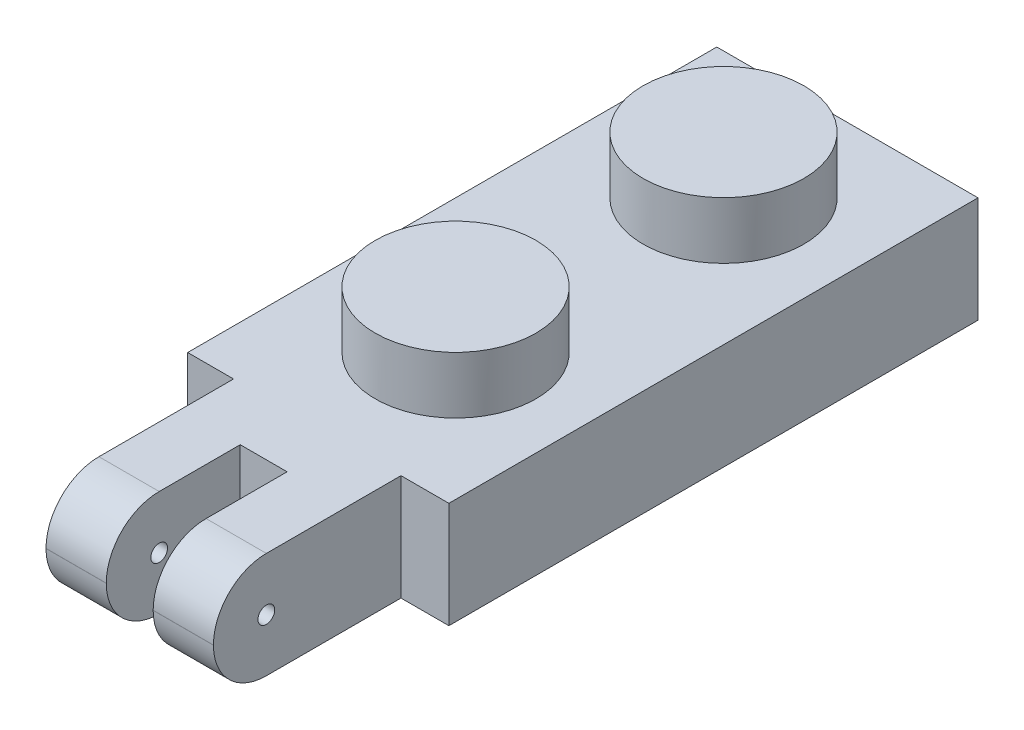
ISO-10303-21;
HEADER;
FILE_DESCRIPTION(('STEP AP214'),'2;1');
FILE_NAME('part.step','',(''),(''),'','','');
FILE_SCHEMA(('AUTOMOTIVE_DESIGN { 1 0 10303 214 1 1 1 1 }'));
ENDSEC;
DATA;
#1=APPLICATION_CONTEXT('core data for automotive mechanical design processes');
#2=APPLICATION_PROTOCOL_DEFINITION('international standard','automotive_design',2000,#1);
#3=PRODUCT_CONTEXT('',#1,'mechanical');
#4=PRODUCT('Part','Part','',(#3));
#5=PRODUCT_RELATED_PRODUCT_CATEGORY('part','',(#4));
#6=PRODUCT_DEFINITION_FORMATION('','',#4);
#7=PRODUCT_DEFINITION_CONTEXT('part definition',#1,'design');
#8=PRODUCT_DEFINITION('design','',#6,#7);
#9=PRODUCT_DEFINITION_SHAPE('','',#8);
#10=(LENGTH_UNIT() NAMED_UNIT(*) SI_UNIT(.MILLI.,.METRE.));
#11=(NAMED_UNIT(*) PLANE_ANGLE_UNIT() SI_UNIT($,.RADIAN.));
#12=(NAMED_UNIT(*) SI_UNIT($,.STERADIAN.) SOLID_ANGLE_UNIT());
#13=UNCERTAINTY_MEASURE_WITH_UNIT(LENGTH_MEASURE(1.E-05),#10,'distance_accuracy_value','');
#14=(GEOMETRIC_REPRESENTATION_CONTEXT(3) GLOBAL_UNCERTAINTY_ASSIGNED_CONTEXT((#13)) GLOBAL_UNIT_ASSIGNED_CONTEXT((#10,
#11,#12)) REPRESENTATION_CONTEXT('',''));
#15=CARTESIAN_POINT('',(0.,0.,0.));
#16=DIRECTION('',(0.,0.,1.));
#17=DIRECTION('',(1.,0.,0.));
#18=AXIS2_PLACEMENT_3D('',#15,#16,#17);
#19=CARTESIAN_POINT('',(1.37,0.,5.6));
#20=DIRECTION('',(0.,0.,1.));
#21=DIRECTION('',(1.,0.,0.));
#22=AXIS2_PLACEMENT_3D('',#19,#20,#21);
#23=PLANE('',#22);
#24=DIRECTION('',(0.,-1.,0.));
#25=VECTOR('',#24,1.);
#26=CARTESIAN_POINT('',(1.37,3.166,5.6));
#27=LINE('',#26,#25);
#28=CARTESIAN_POINT('',(1.37,1.586,5.6));
#29=VERTEX_POINT('',#28);
#30=CARTESIAN_POINT('',(1.37,1.58,5.6));
#31=VERTEX_POINT('',#30);
#32=EDGE_CURVE('E238',#29,#31,#27,.T.);
#33=ORIENTED_EDGE('',*,*,#32,.T.);
#34=DIRECTION('',(1.,0.,0.));
#35=VECTOR('',#34,1.);
#36=CARTESIAN_POINT('',(1.37,1.58,5.6));
#37=LINE('',#36,#35);
#38=CARTESIAN_POINT('',(3.17,1.58,5.6));
#39=VERTEX_POINT('',#38);
#40=EDGE_CURVE('E293',#31,#39,#37,.T.);
#41=ORIENTED_EDGE('',*,*,#40,.T.);
#42=DIRECTION('',(0.,-1.,0.));
#43=VECTOR('',#42,1.);
#44=CARTESIAN_POINT('',(3.17,3.166,5.6));
#45=LINE('',#44,#43);
#46=CARTESIAN_POINT('',(3.17,1.586,5.6));
#47=VERTEX_POINT('',#46);
#48=EDGE_CURVE('E228',#47,#39,#45,.T.);
#49=ORIENTED_EDGE('',*,*,#48,.F.);
#50=DIRECTION('',(-1.,0.,0.));
#51=VECTOR('',#50,1.);
#52=CARTESIAN_POINT('',(1.37,1.586,5.6));
#53=LINE('',#52,#51);
#54=EDGE_CURVE('E258',#47,#29,#53,.T.);
#55=ORIENTED_EDGE('',*,*,#54,.T.);
#56=EDGE_LOOP('',(#33,#41,#49,#55));
#57=FACE_BOUND('',#56,.T.);
#58=ADVANCED_FACE('F36',(#57),#23,.T.);
#59=CARTESIAN_POINT('',(0.,3.166,0.));
#60=DIRECTION('',(0.,0.,-1.));
#61=DIRECTION('',(-1.,0.,0.));
#62=AXIS2_PLACEMENT_3D('',#59,#60,#61);
#63=PLANE('',#62);
#64=DIRECTION('',(0.,-1.,0.));
#65=VECTOR('',#64,1.);
#66=CARTESIAN_POINT('',(1.37,3.166,0.));
#67=LINE('',#66,#65);
#68=CARTESIAN_POINT('',(1.37,3.166,0.));
#69=VERTEX_POINT('',#68);
#70=CARTESIAN_POINT('',(1.37,0.,0.));
#71=VERTEX_POINT('',#70);
#72=EDGE_CURVE('E234',#69,#71,#67,.T.);
#73=ORIENTED_EDGE('',*,*,#72,.F.);
#74=DIRECTION('',(1.,0.,0.));
#75=VECTOR('',#74,1.);
#76=CARTESIAN_POINT('',(0.,3.166,0.));
#77=LINE('',#76,#75);
#78=CARTESIAN_POINT('',(0.,3.166,0.));
#79=VERTEX_POINT('',#78);
#80=EDGE_CURVE('E346',#79,#69,#77,.T.);
#81=ORIENTED_EDGE('',*,*,#80,.F.);
#82=DIRECTION('',(0.,-1.,0.));
#83=VECTOR('',#82,1.);
#84=CARTESIAN_POINT('',(0.,3.166,0.));
#85=LINE('',#84,#83);
#86=CARTESIAN_POINT('',(0.,0.,0.));
#87=VERTEX_POINT('',#86);
#88=EDGE_CURVE('E309',#79,#87,#85,.T.);
#89=ORIENTED_EDGE('',*,*,#88,.T.);
#90=DIRECTION('',(1.,0.,0.));
#91=VECTOR('',#90,1.);
#92=CARTESIAN_POINT('',(0.,0.,0.));
#93=LINE('',#92,#91);
#94=EDGE_CURVE('E313',#87,#71,#93,.T.);
#95=ORIENTED_EDGE('',*,*,#94,.T.);
#96=EDGE_LOOP('',(#73,#81,#89,#95));
#97=FACE_BOUND('',#96,.T.);
#98=ADVANCED_FACE('F344',(#97),#63,.F.);
#99=DIRECTION('',(0.,1.,0.));
#100=VECTOR('',#99,1.);
#101=CARTESIAN_POINT('',(6.37,3.166,0.));
#102=LINE('',#101,#100);
#103=CARTESIAN_POINT('',(6.37,0.,0.));
#104=VERTEX_POINT('',#103);
#105=CARTESIAN_POINT('',(6.37,3.166,0.));
#106=VERTEX_POINT('',#105);
#107=EDGE_CURVE('E242',#104,#106,#102,.T.);
#108=ORIENTED_EDGE('',*,*,#107,.F.);
#109=CARTESIAN_POINT('',(7.8,0.,0.));
#110=VERTEX_POINT('',#109);
#111=EDGE_CURVE('E318',#104,#110,#93,.T.);
#112=ORIENTED_EDGE('',*,*,#111,.T.);
#113=DIRECTION('',(0.,-1.,0.));
#114=VECTOR('',#113,1.);
#115=CARTESIAN_POINT('',(7.8,3.166,0.));
#116=LINE('',#115,#114);
#117=CARTESIAN_POINT('',(7.8,3.166,0.));
#118=VERTEX_POINT('',#117);
#119=EDGE_CURVE('E337',#118,#110,#116,.T.);
#120=ORIENTED_EDGE('',*,*,#119,.F.);
#121=EDGE_CURVE('E367',#106,#118,#77,.T.);
#122=ORIENTED_EDGE('',*,*,#121,.F.);
#123=EDGE_LOOP('',(#108,#112,#120,#122));
#124=FACE_BOUND('',#123,.T.);
#125=ADVANCED_FACE('F382',(#124),#63,.F.);
#126=CARTESIAN_POINT('',(0.,3.166,-15.8));
#127=DIRECTION('',(0.,-1.,0.));
#128=DIRECTION('',(0.,0.,-1.));
#129=AXIS2_PLACEMENT_3D('',#126,#127,#128);
#130=PLANE('',#129);
#131=DIRECTION('',(0.,0.,1.));
#132=VECTOR('',#131,1.);
#133=CARTESIAN_POINT('',(4.57,3.166,1.6));
#134=LINE('',#133,#132);
#135=CARTESIAN_POINT('',(4.57,3.166,1.6));
#136=VERTEX_POINT('',#135);
#137=CARTESIAN_POINT('',(4.57,3.166,4.02));
#138=VERTEX_POINT('',#137);
#139=EDGE_CURVE('E235',#136,#138,#134,.T.);
#140=ORIENTED_EDGE('',*,*,#139,.T.);
#141=DIRECTION('',(-1.,0.,0.));
#142=VECTOR('',#141,1.);
#143=CARTESIAN_POINT('',(6.37,3.166,4.02));
#144=LINE('',#143,#142);
#145=CARTESIAN_POINT('',(6.37,3.166,4.02));
#146=VERTEX_POINT('',#145);
#147=EDGE_CURVE('E11',#138,#146,#144,.F.);
#148=ORIENTED_EDGE('',*,*,#147,.T.);
#149=DIRECTION('',(0.,0.,-1.));
#150=VECTOR('',#149,1.);
#151=CARTESIAN_POINT('',(6.37,3.166,5.6));
#152=LINE('',#151,#150);
#153=EDGE_CURVE('E263',#146,#106,#152,.T.);
#154=ORIENTED_EDGE('',*,*,#153,.T.);
#155=ORIENTED_EDGE('',*,*,#121,.T.);
#156=DIRECTION('',(0.,0.,-1.));
#157=VECTOR('',#156,1.);
#158=CARTESIAN_POINT('',(7.8,3.166,0.));
#159=LINE('',#158,#157);
#160=CARTESIAN_POINT('',(7.8,3.166,-15.8));
#161=VERTEX_POINT('',#160);
#162=EDGE_CURVE('E370',#118,#161,#159,.T.);
#163=ORIENTED_EDGE('',*,*,#162,.T.);
#164=DIRECTION('',(-1.,0.,0.));
#165=VECTOR('',#164,1.);
#166=CARTESIAN_POINT('',(0.,3.166,-15.8));
#167=LINE('',#166,#165);
#168=CARTESIAN_POINT('',(0.,3.166,-15.8));
#169=VERTEX_POINT('',#168);
#170=EDGE_CURVE('E334',#161,#169,#167,.T.);
#171=ORIENTED_EDGE('',*,*,#170,.T.);
#172=DIRECTION('',(0.,0.,1.));
#173=VECTOR('',#172,1.);
#174=CARTESIAN_POINT('',(0.,3.166,0.));
#175=LINE('',#174,#173);
#176=EDGE_CURVE('E329',#169,#79,#175,.T.);
#177=ORIENTED_EDGE('',*,*,#176,.T.);
#178=ORIENTED_EDGE('',*,*,#80,.T.);
#179=DIRECTION('',(0.,0.,-1.));
#180=VECTOR('',#179,1.);
#181=CARTESIAN_POINT('',(1.37,3.166,5.6));
#182=LINE('',#181,#180);
#183=CARTESIAN_POINT('',(1.37,3.166,4.02));
#184=VERTEX_POINT('',#183);
#185=EDGE_CURVE('E245',#184,#69,#182,.T.);
#186=ORIENTED_EDGE('',*,*,#185,.F.);
#187=DIRECTION('',(-1.,0.,0.));
#188=VECTOR('',#187,1.);
#189=CARTESIAN_POINT('',(3.17,3.166,4.02));
#190=LINE('',#189,#188);
#191=CARTESIAN_POINT('',(3.17,3.166,4.02));
#192=VERTEX_POINT('',#191);
#193=EDGE_CURVE('E45',#184,#192,#190,.F.);
#194=ORIENTED_EDGE('',*,*,#193,.T.);
#195=DIRECTION('',(0.,0.,1.));
#196=VECTOR('',#195,1.);
#197=CARTESIAN_POINT('',(3.17,3.166,1.6));
#198=LINE('',#197,#196);
#199=CARTESIAN_POINT('',(3.17,3.166,1.6));
#200=VERTEX_POINT('',#199);
#201=EDGE_CURVE('E232',#200,#192,#198,.T.);
#202=ORIENTED_EDGE('',*,*,#201,.F.);
#203=DIRECTION('',(-1.,0.,0.));
#204=VECTOR('',#203,1.);
#205=CARTESIAN_POINT('',(3.17,3.166,1.6));
#206=LINE('',#205,#204);
#207=EDGE_CURVE('E207',#136,#200,#206,.T.);
#208=ORIENTED_EDGE('',*,*,#207,.F.);
#209=EDGE_LOOP('',(#140,#148,#154,#155,#163,#171,#177,#178,#186,#194,#202,#208));
#210=FACE_BOUND('',#209,.T.);
#211=CARTESIAN_POINT('',(4.,3.166,-4.));
#212=DIRECTION('',(0.,-1.,0.));
#213=DIRECTION('',(0.,0.,-1.));
#214=AXIS2_PLACEMENT_3D('',#211,#212,#213);
#215=CIRCLE('',#214,2.4);
#216=CARTESIAN_POINT('',(4.,3.166,-6.4));
#217=VERTEX_POINT('',#216);
#218=EDGE_CURVE('E304',#217,#217,#215,.F.);
#219=ORIENTED_EDGE('',*,*,#218,.F.);
#220=EDGE_LOOP('',(#219));
#221=FACE_BOUND('',#220,.T.);
#222=CARTESIAN_POINT('',(4.,3.166,-12.));
#223=DIRECTION('',(0.,-1.,0.));
#224=DIRECTION('',(0.,0.,-1.));
#225=AXIS2_PLACEMENT_3D('',#222,#223,#224);
#226=CIRCLE('',#225,2.4);
#227=CARTESIAN_POINT('',(4.,3.166,-14.4));
#228=VERTEX_POINT('',#227);
#229=EDGE_CURVE('E300',#228,#228,#226,.F.);
#230=ORIENTED_EDGE('',*,*,#229,.F.);
#231=EDGE_LOOP('',(#230));
#232=FACE_BOUND('',#231,.T.);
#233=ADVANCED_FACE('F375',(#210,#221,#232),#130,.F.);
#234=CARTESIAN_POINT('',(0.,3.166,0.));
#235=DIRECTION('',(1.,0.,0.));
#236=DIRECTION('',(0.,0.,-1.));
#237=AXIS2_PLACEMENT_3D('',#234,#235,#236);
#238=PLANE('',#237);
#239=DIRECTION('',(0.,0.,1.));
#240=VECTOR('',#239,1.);
#241=CARTESIAN_POINT('',(0.,0.,0.));
#242=LINE('',#241,#240);
#243=CARTESIAN_POINT('',(0.,0.,-15.8));
#244=VERTEX_POINT('',#243);
#245=EDGE_CURVE('E323',#244,#87,#242,.T.);
#246=ORIENTED_EDGE('',*,*,#245,.T.);
#247=ORIENTED_EDGE('',*,*,#88,.F.);
#248=ORIENTED_EDGE('',*,*,#176,.F.);
#249=DIRECTION('',(0.,-1.,0.));
#250=VECTOR('',#249,1.);
#251=CARTESIAN_POINT('',(0.,3.166,-15.8));
#252=LINE('',#251,#250);
#253=EDGE_CURVE('E330',#169,#244,#252,.T.);
#254=ORIENTED_EDGE('',*,*,#253,.T.);
#255=EDGE_LOOP('',(#246,#247,#248,#254));
#256=FACE_BOUND('',#255,.T.);
#257=ADVANCED_FACE('F351',(#256),#238,.F.);
#258=CARTESIAN_POINT('',(7.8,3.166,0.));
#259=DIRECTION('',(-1.,0.,0.));
#260=DIRECTION('',(0.,0.,1.));
#261=AXIS2_PLACEMENT_3D('',#258,#259,#260);
#262=PLANE('',#261);
#263=DIRECTION('',(0.,0.,-1.));
#264=VECTOR('',#263,1.);
#265=CARTESIAN_POINT('',(7.8,0.,0.));
#266=LINE('',#265,#264);
#267=CARTESIAN_POINT('',(7.8,0.,-15.8));
#268=VERTEX_POINT('',#267);
#269=EDGE_CURVE('E317',#110,#268,#266,.T.);
#270=ORIENTED_EDGE('',*,*,#269,.T.);
#271=DIRECTION('',(0.,-1.,0.));
#272=VECTOR('',#271,1.);
#273=CARTESIAN_POINT('',(7.8,3.166,-15.8));
#274=LINE('',#273,#272);
#275=EDGE_CURVE('E333',#161,#268,#274,.T.);
#276=ORIENTED_EDGE('',*,*,#275,.F.);
#277=ORIENTED_EDGE('',*,*,#162,.F.);
#278=ORIENTED_EDGE('',*,*,#119,.T.);
#279=EDGE_LOOP('',(#270,#276,#277,#278));
#280=FACE_BOUND('',#279,.T.);
#281=ADVANCED_FACE('F386',(#280),#262,.F.);
#282=CARTESIAN_POINT('',(0.,3.166,-15.8));
#283=DIRECTION('',(0.,0.,1.));
#284=DIRECTION('',(1.,0.,0.));
#285=AXIS2_PLACEMENT_3D('',#282,#283,#284);
#286=PLANE('',#285);
#287=DIRECTION('',(-1.,0.,0.));
#288=VECTOR('',#287,1.);
#289=CARTESIAN_POINT('',(0.,0.,-15.8));
#290=LINE('',#289,#288);
#291=EDGE_CURVE('E327',#268,#244,#290,.T.);
#292=ORIENTED_EDGE('',*,*,#291,.T.);
#293=ORIENTED_EDGE('',*,*,#253,.F.);
#294=ORIENTED_EDGE('',*,*,#170,.F.);
#295=ORIENTED_EDGE('',*,*,#275,.T.);
#296=EDGE_LOOP('',(#292,#293,#294,#295));
#297=FACE_BOUND('',#296,.T.);
#298=ADVANCED_FACE('F389',(#297),#286,.F.);
#299=CARTESIAN_POINT('',(0.,0.,-15.8));
#300=DIRECTION('',(0.,-1.,0.));
#301=DIRECTION('',(0.,0.,-1.));
#302=AXIS2_PLACEMENT_3D('',#299,#300,#301);
#303=PLANE('',#302);
#304=DIRECTION('',(0.,0.,1.));
#305=VECTOR('',#304,1.);
#306=CARTESIAN_POINT('',(3.17,0.,1.6));
#307=LINE('',#306,#305);
#308=CARTESIAN_POINT('',(3.17,0.,1.6));
#309=VERTEX_POINT('',#308);
#310=CARTESIAN_POINT('',(3.17,0.,4.02));
#311=VERTEX_POINT('',#310);
#312=EDGE_CURVE('E195',#309,#311,#307,.T.);
#313=ORIENTED_EDGE('',*,*,#312,.T.);
#314=DIRECTION('',(1.,0.,0.));
#315=VECTOR('',#314,1.);
#316=CARTESIAN_POINT('',(0.,0.,4.02));
#317=LINE('',#316,#315);
#318=CARTESIAN_POINT('',(1.37,0.,4.02));
#319=VERTEX_POINT('',#318);
#320=EDGE_CURVE('E264',#311,#319,#317,.F.);
#321=ORIENTED_EDGE('',*,*,#320,.T.);
#322=DIRECTION('',(0.,0.,-1.));
#323=VECTOR('',#322,1.);
#324=CARTESIAN_POINT('',(1.37,0.,5.6));
#325=LINE('',#324,#323);
#326=EDGE_CURVE('E287',#319,#71,#325,.T.);
#327=ORIENTED_EDGE('',*,*,#326,.T.);
#328=ORIENTED_EDGE('',*,*,#94,.F.);
#329=ORIENTED_EDGE('',*,*,#245,.F.);
#330=ORIENTED_EDGE('',*,*,#291,.F.);
#331=ORIENTED_EDGE('',*,*,#269,.F.);
#332=ORIENTED_EDGE('',*,*,#111,.F.);
#333=DIRECTION('',(0.,0.,-1.));
#334=VECTOR('',#333,1.);
#335=CARTESIAN_POINT('',(6.37,0.,5.6));
#336=LINE('',#335,#334);
#337=CARTESIAN_POINT('',(6.37,0.,4.02));
#338=VERTEX_POINT('',#337);
#339=EDGE_CURVE('E279',#338,#104,#336,.T.);
#340=ORIENTED_EDGE('',*,*,#339,.F.);
#341=DIRECTION('',(1.,0.,0.));
#342=VECTOR('',#341,1.);
#343=CARTESIAN_POINT('',(0.,0.,4.02));
#344=LINE('',#343,#342);
#345=CARTESIAN_POINT('',(4.57,0.,4.02));
#346=VERTEX_POINT('',#345);
#347=EDGE_CURVE('E289',#338,#346,#344,.F.);
#348=ORIENTED_EDGE('',*,*,#347,.T.);
#349=DIRECTION('',(0.,0.,1.));
#350=VECTOR('',#349,1.);
#351=CARTESIAN_POINT('',(4.57,0.,1.6));
#352=LINE('',#351,#350);
#353=CARTESIAN_POINT('',(4.57,0.,1.6));
#354=VERTEX_POINT('',#353);
#355=EDGE_CURVE('E206',#354,#346,#352,.T.);
#356=ORIENTED_EDGE('',*,*,#355,.F.);
#357=DIRECTION('',(1.,0.,0.));
#358=VECTOR('',#357,1.);
#359=CARTESIAN_POINT('',(3.17,0.,1.6));
#360=LINE('',#359,#358);
#361=EDGE_CURVE('E213',#309,#354,#360,.T.);
#362=ORIENTED_EDGE('',*,*,#361,.F.);
#363=EDGE_LOOP('',(#313,#321,#327,#328,#329,#330,#331,#332,#340,#348,#356,#362));
#364=FACE_BOUND('',#363,.T.);
#365=DIRECTION('',(0.,0.,-1.));
#366=VECTOR('',#365,1.);
#367=CARTESIAN_POINT('',(1.45,0.,-1.45));
#368=LINE('',#367,#366);
#369=CARTESIAN_POINT('',(1.45,0.,-1.45));
#370=VERTEX_POINT('',#369);
#371=CARTESIAN_POINT('',(1.45,0.,-6.35));
#372=VERTEX_POINT('',#371);
#373=EDGE_CURVE('E545',#370,#372,#368,.T.);
#374=ORIENTED_EDGE('',*,*,#373,.F.);
#375=DIRECTION('',(-1.,0.,0.));
#376=VECTOR('',#375,1.);
#377=CARTESIAN_POINT('',(1.45,0.,-1.45));
#378=LINE('',#377,#376);
#379=CARTESIAN_POINT('',(6.35,0.,-1.45));
#380=VERTEX_POINT('',#379);
#381=EDGE_CURVE('E540',#380,#370,#378,.T.);
#382=ORIENTED_EDGE('',*,*,#381,.F.);
#383=DIRECTION('',(0.,0.,1.));
#384=VECTOR('',#383,1.);
#385=CARTESIAN_POINT('',(6.35,0.,-1.45));
#386=LINE('',#385,#384);
#387=CARTESIAN_POINT('',(6.35,0.,-6.35));
#388=VERTEX_POINT('',#387);
#389=EDGE_CURVE('E535',#388,#380,#386,.T.);
#390=ORIENTED_EDGE('',*,*,#389,.F.);
#391=DIRECTION('',(1.,0.,0.));
#392=VECTOR('',#391,1.);
#393=CARTESIAN_POINT('',(1.45,0.,-6.35));
#394=LINE('',#393,#392);
#395=EDGE_CURVE('E516',#372,#388,#394,.T.);
#396=ORIENTED_EDGE('',*,*,#395,.F.);
#397=EDGE_LOOP('',(#374,#382,#390,#396));
#398=FACE_BOUND('',#397,.T.);
#399=DIRECTION('',(0.,0.,-1.));
#400=VECTOR('',#399,1.);
#401=CARTESIAN_POINT('',(1.45,0.,-9.45));
#402=LINE('',#401,#400);
#403=CARTESIAN_POINT('',(1.45,0.,-9.45));
#404=VERTEX_POINT('',#403);
#405=CARTESIAN_POINT('',(1.45,0.,-14.35));
#406=VERTEX_POINT('',#405);
#407=EDGE_CURVE('E550',#404,#406,#402,.T.);
#408=ORIENTED_EDGE('',*,*,#407,.F.);
#409=DIRECTION('',(-1.,0.,0.));
#410=VECTOR('',#409,1.);
#411=CARTESIAN_POINT('',(1.45,0.,-9.45));
#412=LINE('',#411,#410);
#413=CARTESIAN_POINT('',(6.35,0.,-9.45));
#414=VERTEX_POINT('',#413);
#415=EDGE_CURVE('E555',#414,#404,#412,.T.);
#416=ORIENTED_EDGE('',*,*,#415,.F.);
#417=DIRECTION('',(0.,0.,1.));
#418=VECTOR('',#417,1.);
#419=CARTESIAN_POINT('',(6.35,0.,-9.45));
#420=LINE('',#419,#418);
#421=CARTESIAN_POINT('',(6.35,0.,-14.35));
#422=VERTEX_POINT('',#421);
#423=EDGE_CURVE('E568',#422,#414,#420,.T.);
#424=ORIENTED_EDGE('',*,*,#423,.F.);
#425=DIRECTION('',(1.,0.,0.));
#426=VECTOR('',#425,1.);
#427=CARTESIAN_POINT('',(1.45,0.,-14.35));
#428=LINE('',#427,#426);
#429=EDGE_CURVE('E565',#406,#422,#428,.T.);
#430=ORIENTED_EDGE('',*,*,#429,.F.);
#431=EDGE_LOOP('',(#408,#416,#424,#430));
#432=FACE_BOUND('',#431,.T.);
#433=ADVANCED_FACE('F219',(#364,#398,#432),#303,.T.);
#434=CARTESIAN_POINT('',(4.,4.866,-4.));
#435=DIRECTION('',(0.,-1.,0.));
#436=DIRECTION('',(0.,0.,-1.));
#437=AXIS2_PLACEMENT_3D('',#434,#435,#436);
#438=CYLINDRICAL_SURFACE('',#437,2.4);
#439=CARTESIAN_POINT('',(4.,4.866,-4.));
#440=DIRECTION('',(0.,1.,0.));
#441=DIRECTION('',(0.,0.,1.));
#442=AXIS2_PLACEMENT_3D('',#439,#440,#441);
#443=CIRCLE('',#442,2.4);
#444=CARTESIAN_POINT('',(4.,4.866,-1.6));
#445=VERTEX_POINT('',#444);
#446=EDGE_CURVE('E354',#445,#445,#443,.T.);
#447=ORIENTED_EDGE('',*,*,#446,.F.);
#448=EDGE_LOOP('',(#447));
#449=FACE_BOUND('',#448,.T.);
#450=ORIENTED_EDGE('',*,*,#218,.T.);
#451=EDGE_LOOP('',(#450));
#452=FACE_BOUND('',#451,.T.);
#453=ADVANCED_FACE('F493',(#449,#452),#438,.T.);
#454=CARTESIAN_POINT('',(4.,4.866,-4.));
#455=DIRECTION('',(0.,1.,0.));
#456=DIRECTION('',(0.,0.,1.));
#457=AXIS2_PLACEMENT_3D('',#454,#455,#456);
#458=PLANE('',#457);
#459=ORIENTED_EDGE('',*,*,#446,.T.);
#460=EDGE_LOOP('',(#459));
#461=FACE_BOUND('',#460,.T.);
#462=ADVANCED_FACE('F489',(#461),#458,.T.);
#463=CARTESIAN_POINT('',(1.45,2.5,-9.45));
#464=DIRECTION('',(-1.,0.,0.));
#465=DIRECTION('',(0.,0.,1.));
#466=AXIS2_PLACEMENT_3D('',#463,#464,#465);
#467=PLANE('',#466);
#468=ORIENTED_EDGE('',*,*,#407,.T.);
#469=DIRECTION('',(0.,-1.,0.));
#470=VECTOR('',#469,1.);
#471=CARTESIAN_POINT('',(1.45,2.5,-14.35));
#472=LINE('',#471,#470);
#473=CARTESIAN_POINT('',(1.45,2.5,-14.35));
#474=VERTEX_POINT('',#473);
#475=EDGE_CURVE('E364',#474,#406,#472,.T.);
#476=ORIENTED_EDGE('',*,*,#475,.F.);
#477=DIRECTION('',(0.,0.,-1.));
#478=VECTOR('',#477,1.);
#479=CARTESIAN_POINT('',(1.45,2.5,-9.45));
#480=LINE('',#479,#478);
#481=CARTESIAN_POINT('',(1.45,2.5,-9.45));
#482=VERTEX_POINT('',#481);
#483=EDGE_CURVE('E551',#482,#474,#480,.T.);
#484=ORIENTED_EDGE('',*,*,#483,.F.);
#485=DIRECTION('',(0.,-1.,0.));
#486=VECTOR('',#485,1.);
#487=CARTESIAN_POINT('',(1.45,2.5,-9.45));
#488=LINE('',#487,#486);
#489=EDGE_CURVE('E356',#482,#404,#488,.T.);
#490=ORIENTED_EDGE('',*,*,#489,.T.);
#491=EDGE_LOOP('',(#468,#476,#484,#490));
#492=FACE_BOUND('',#491,.T.);
#493=ADVANCED_FACE('F479',(#492),#467,.F.);
#494=CARTESIAN_POINT('',(1.45,2.5,-9.45));
#495=DIRECTION('',(0.,0.,1.));
#496=DIRECTION('',(1.,0.,0.));
#497=AXIS2_PLACEMENT_3D('',#494,#495,#496);
#498=PLANE('',#497);
#499=ORIENTED_EDGE('',*,*,#415,.T.);
#500=ORIENTED_EDGE('',*,*,#489,.F.);
#501=DIRECTION('',(-1.,0.,0.));
#502=VECTOR('',#501,1.);
#503=CARTESIAN_POINT('',(1.45,2.5,-9.45));
#504=LINE('',#503,#502);
#505=CARTESIAN_POINT('',(6.35,2.5,-9.45));
#506=VERTEX_POINT('',#505);
#507=EDGE_CURVE('E561',#506,#482,#504,.T.);
#508=ORIENTED_EDGE('',*,*,#507,.F.);
#509=DIRECTION('',(0.,-1.,0.));
#510=VECTOR('',#509,1.);
#511=CARTESIAN_POINT('',(6.35,2.5,-9.45));
#512=LINE('',#511,#510);
#513=EDGE_CURVE('E360',#506,#414,#512,.T.);
#514=ORIENTED_EDGE('',*,*,#513,.T.);
#515=EDGE_LOOP('',(#499,#500,#508,#514));
#516=FACE_BOUND('',#515,.T.);
#517=ADVANCED_FACE('F475',(#516),#498,.F.);
#518=CARTESIAN_POINT('',(6.35,2.5,-9.45));
#519=DIRECTION('',(1.,0.,0.));
#520=DIRECTION('',(0.,0.,-1.));
#521=AXIS2_PLACEMENT_3D('',#518,#519,#520);
#522=PLANE('',#521);
#523=ORIENTED_EDGE('',*,*,#423,.T.);
#524=ORIENTED_EDGE('',*,*,#513,.F.);
#525=DIRECTION('',(0.,0.,1.));
#526=VECTOR('',#525,1.);
#527=CARTESIAN_POINT('',(6.35,2.5,-9.45));
#528=LINE('',#527,#526);
#529=CARTESIAN_POINT('',(6.35,2.5,-14.35));
#530=VERTEX_POINT('',#529);
#531=EDGE_CURVE('E558',#530,#506,#528,.T.);
#532=ORIENTED_EDGE('',*,*,#531,.F.);
#533=DIRECTION('',(0.,-1.,0.));
#534=VECTOR('',#533,1.);
#535=CARTESIAN_POINT('',(6.35,2.5,-14.35));
#536=LINE('',#535,#534);
#537=EDGE_CURVE('E573',#530,#422,#536,.T.);
#538=ORIENTED_EDGE('',*,*,#537,.T.);
#539=EDGE_LOOP('',(#523,#524,#532,#538));
#540=FACE_BOUND('',#539,.T.);
#541=ADVANCED_FACE('F478',(#540),#522,.F.);
#542=CARTESIAN_POINT('',(1.45,2.5,-14.35));
#543=DIRECTION('',(0.,0.,-1.));
#544=DIRECTION('',(-1.,0.,0.));
#545=AXIS2_PLACEMENT_3D('',#542,#543,#544);
#546=PLANE('',#545);
#547=ORIENTED_EDGE('',*,*,#429,.T.);
#548=ORIENTED_EDGE('',*,*,#537,.F.);
#549=DIRECTION('',(1.,0.,0.));
#550=VECTOR('',#549,1.);
#551=CARTESIAN_POINT('',(1.45,2.5,-14.35));
#552=LINE('',#551,#550);
#553=EDGE_CURVE('E554',#474,#530,#552,.T.);
#554=ORIENTED_EDGE('',*,*,#553,.F.);
#555=ORIENTED_EDGE('',*,*,#475,.T.);
#556=EDGE_LOOP('',(#547,#548,#554,#555));
#557=FACE_BOUND('',#556,.T.);
#558=ADVANCED_FACE('F473',(#557),#546,.F.);
#559=CARTESIAN_POINT('',(1.45,2.5,-14.35));
#560=DIRECTION('',(0.,-1.,0.));
#561=DIRECTION('',(0.,0.,-1.));
#562=AXIS2_PLACEMENT_3D('',#559,#560,#561);
#563=PLANE('',#562);
#564=ORIENTED_EDGE('',*,*,#483,.T.);
#565=ORIENTED_EDGE('',*,*,#553,.T.);
#566=ORIENTED_EDGE('',*,*,#531,.T.);
#567=ORIENTED_EDGE('',*,*,#507,.T.);
#568=EDGE_LOOP('',(#564,#565,#566,#567));
#569=FACE_BOUND('',#568,.T.);
#570=ADVANCED_FACE('F467',(#569),#563,.T.);
#571=CARTESIAN_POINT('',(4.,4.866,-12.));
#572=DIRECTION('',(0.,-1.,0.));
#573=DIRECTION('',(0.,0.,-1.));
#574=AXIS2_PLACEMENT_3D('',#571,#572,#573);
#575=CYLINDRICAL_SURFACE('',#574,2.4);
#576=CARTESIAN_POINT('',(4.,4.866,-12.));
#577=DIRECTION('',(0.,1.,0.));
#578=DIRECTION('',(0.,0.,1.));
#579=AXIS2_PLACEMENT_3D('',#576,#577,#578);
#580=CIRCLE('',#579,2.4);
#581=CARTESIAN_POINT('',(4.,4.866,-9.6));
#582=VERTEX_POINT('',#581);
#583=EDGE_CURVE('E547',#582,#582,#580,.T.);
#584=ORIENTED_EDGE('',*,*,#583,.F.);
#585=EDGE_LOOP('',(#584));
#586=FACE_BOUND('',#585,.T.);
#587=ORIENTED_EDGE('',*,*,#229,.T.);
#588=EDGE_LOOP('',(#587));
#589=FACE_BOUND('',#588,.T.);
#590=ADVANCED_FACE('F448',(#586,#589),#575,.T.);
#591=CARTESIAN_POINT('',(4.,4.866,-12.));
#592=DIRECTION('',(0.,1.,0.));
#593=DIRECTION('',(0.,0.,1.));
#594=AXIS2_PLACEMENT_3D('',#591,#592,#593);
#595=PLANE('',#594);
#596=ORIENTED_EDGE('',*,*,#583,.T.);
#597=EDGE_LOOP('',(#596));
#598=FACE_BOUND('',#597,.T.);
#599=ADVANCED_FACE('F462',(#598),#595,.T.);
#600=CARTESIAN_POINT('',(1.45,2.5,-1.45));
#601=DIRECTION('',(-1.,0.,0.));
#602=DIRECTION('',(0.,0.,1.));
#603=AXIS2_PLACEMENT_3D('',#600,#601,#602);
#604=PLANE('',#603);
#605=ORIENTED_EDGE('',*,*,#373,.T.);
#606=DIRECTION('',(0.,-1.,0.));
#607=VECTOR('',#606,1.);
#608=CARTESIAN_POINT('',(1.45,2.5,-6.35));
#609=LINE('',#608,#607);
#610=CARTESIAN_POINT('',(1.45,2.5,-6.35));
#611=VERTEX_POINT('',#610);
#612=EDGE_CURVE('E533',#611,#372,#609,.T.);
#613=ORIENTED_EDGE('',*,*,#612,.F.);
#614=DIRECTION('',(0.,0.,-1.));
#615=VECTOR('',#614,1.);
#616=CARTESIAN_POINT('',(1.45,2.5,-1.45));
#617=LINE('',#616,#615);
#618=CARTESIAN_POINT('',(1.45,2.5,-1.45));
#619=VERTEX_POINT('',#618);
#620=EDGE_CURVE('E517',#619,#611,#617,.T.);
#621=ORIENTED_EDGE('',*,*,#620,.F.);
#622=DIRECTION('',(0.,-1.,0.));
#623=VECTOR('',#622,1.);
#624=CARTESIAN_POINT('',(1.45,2.5,-1.45));
#625=LINE('',#624,#623);
#626=EDGE_CURVE('E542',#619,#370,#625,.T.);
#627=ORIENTED_EDGE('',*,*,#626,.T.);
#628=EDGE_LOOP('',(#605,#613,#621,#627));
#629=FACE_BOUND('',#628,.T.);
#630=ADVANCED_FACE('F441',(#629),#604,.F.);
#631=CARTESIAN_POINT('',(1.45,2.5,-1.45));
#632=DIRECTION('',(0.,0.,1.));
#633=DIRECTION('',(1.,0.,0.));
#634=AXIS2_PLACEMENT_3D('',#631,#632,#633);
#635=PLANE('',#634);
#636=ORIENTED_EDGE('',*,*,#381,.T.);
#637=ORIENTED_EDGE('',*,*,#626,.F.);
#638=DIRECTION('',(-1.,0.,0.));
#639=VECTOR('',#638,1.);
#640=CARTESIAN_POINT('',(1.45,2.5,-1.45));
#641=LINE('',#640,#639);
#642=CARTESIAN_POINT('',(6.35,2.5,-1.45));
#643=VERTEX_POINT('',#642);
#644=EDGE_CURVE('E528',#643,#619,#641,.T.);
#645=ORIENTED_EDGE('',*,*,#644,.F.);
#646=DIRECTION('',(0.,-1.,0.));
#647=VECTOR('',#646,1.);
#648=CARTESIAN_POINT('',(6.35,2.5,-1.45));
#649=LINE('',#648,#647);
#650=EDGE_CURVE('E537',#643,#380,#649,.T.);
#651=ORIENTED_EDGE('',*,*,#650,.T.);
#652=EDGE_LOOP('',(#636,#637,#645,#651));
#653=FACE_BOUND('',#652,.T.);
#654=ADVANCED_FACE('F455',(#653),#635,.F.);
#655=CARTESIAN_POINT('',(6.35,2.5,-1.45));
#656=DIRECTION('',(1.,0.,0.));
#657=DIRECTION('',(0.,0.,-1.));
#658=AXIS2_PLACEMENT_3D('',#655,#656,#657);
#659=PLANE('',#658);
#660=ORIENTED_EDGE('',*,*,#389,.T.);
#661=ORIENTED_EDGE('',*,*,#650,.F.);
#662=DIRECTION('',(0.,0.,1.));
#663=VECTOR('',#662,1.);
#664=CARTESIAN_POINT('',(6.35,2.5,-1.45));
#665=LINE('',#664,#663);
#666=CARTESIAN_POINT('',(6.35,2.5,-6.35));
#667=VERTEX_POINT('',#666);
#668=EDGE_CURVE('E526',#667,#643,#665,.T.);
#669=ORIENTED_EDGE('',*,*,#668,.F.);
#670=DIRECTION('',(0.,-1.,0.));
#671=VECTOR('',#670,1.);
#672=CARTESIAN_POINT('',(6.35,2.5,-6.35));
#673=LINE('',#672,#671);
#674=EDGE_CURVE('E531',#667,#388,#673,.T.);
#675=ORIENTED_EDGE('',*,*,#674,.T.);
#676=EDGE_LOOP('',(#660,#661,#669,#675));
#677=FACE_BOUND('',#676,.T.);
#678=ADVANCED_FACE('F451',(#677),#659,.F.);
#679=CARTESIAN_POINT('',(1.45,2.5,-6.35));
#680=DIRECTION('',(0.,0.,-1.));
#681=DIRECTION('',(-1.,0.,0.));
#682=AXIS2_PLACEMENT_3D('',#679,#680,#681);
#683=PLANE('',#682);
#684=ORIENTED_EDGE('',*,*,#395,.T.);
#685=ORIENTED_EDGE('',*,*,#674,.F.);
#686=DIRECTION('',(1.,0.,0.));
#687=VECTOR('',#686,1.);
#688=CARTESIAN_POINT('',(1.45,2.5,-6.35));
#689=LINE('',#688,#687);
#690=EDGE_CURVE('E522',#611,#667,#689,.T.);
#691=ORIENTED_EDGE('',*,*,#690,.F.);
#692=ORIENTED_EDGE('',*,*,#612,.T.);
#693=EDGE_LOOP('',(#684,#685,#691,#692));
#694=FACE_BOUND('',#693,.T.);
#695=ADVANCED_FACE('F446',(#694),#683,.F.);
#696=CARTESIAN_POINT('',(1.45,2.5,-6.35));
#697=DIRECTION('',(0.,-1.,0.));
#698=DIRECTION('',(0.,0.,-1.));
#699=AXIS2_PLACEMENT_3D('',#696,#697,#698);
#700=PLANE('',#699);
#701=ORIENTED_EDGE('',*,*,#620,.T.);
#702=ORIENTED_EDGE('',*,*,#690,.T.);
#703=ORIENTED_EDGE('',*,*,#668,.T.);
#704=ORIENTED_EDGE('',*,*,#644,.T.);
#705=EDGE_LOOP('',(#701,#702,#703,#704));
#706=FACE_BOUND('',#705,.T.);
#707=ADVANCED_FACE('F438',(#706),#700,.T.);
#708=CARTESIAN_POINT('',(1.37,3.166,5.6));
#709=DIRECTION('',(1.,0.,0.));
#710=DIRECTION('',(0.,1.,0.));
#711=AXIS2_PLACEMENT_3D('',#708,#709,#710);
#712=PLANE('',#711);
#713=CARTESIAN_POINT('',(1.37,1.58,4.02));
#714=DIRECTION('',(-1.,0.,0.));
#715=DIRECTION('',(0.,-1.,0.));
#716=AXIS2_PLACEMENT_3D('',#713,#714,#715);
#717=CIRCLE('',#716,0.25);
#718=CARTESIAN_POINT('',(1.37,1.33,4.02));
#719=VERTEX_POINT('',#718);
#720=EDGE_CURVE('E617',#719,#719,#717,.T.);
#721=ORIENTED_EDGE('',*,*,#720,.F.);
#722=EDGE_LOOP('',(#721));
#723=FACE_BOUND('',#722,.T.);
#724=ORIENTED_EDGE('',*,*,#326,.F.);
#725=CARTESIAN_POINT('',(1.37,1.58,4.02));
#726=DIRECTION('',(1.,0.,0.));
#727=DIRECTION('',(0.,1.,0.));
#728=AXIS2_PLACEMENT_3D('',#725,#726,#727);
#729=CIRCLE('',#728,1.58);
#730=EDGE_CURVE('E268',#319,#31,#729,.F.);
#731=ORIENTED_EDGE('',*,*,#730,.T.);
#732=ORIENTED_EDGE('',*,*,#32,.F.);
#733=CARTESIAN_POINT('',(1.37,1.586,4.02));
#734=DIRECTION('',(1.,0.,0.));
#735=DIRECTION('',(0.,1.,0.));
#736=AXIS2_PLACEMENT_3D('',#733,#734,#735);
#737=CIRCLE('',#736,1.58);
#738=EDGE_CURVE('E266',#29,#184,#737,.F.);
#739=ORIENTED_EDGE('',*,*,#738,.T.);
#740=ORIENTED_EDGE('',*,*,#185,.T.);
#741=ORIENTED_EDGE('',*,*,#72,.T.);
#742=EDGE_LOOP('',(#724,#731,#732,#739,#740,#741));
#743=FACE_BOUND('',#742,.T.);
#744=ADVANCED_FACE('F433',(#723,#743),#712,.F.);
#745=CARTESIAN_POINT('',(6.37,3.166,5.6));
#746=DIRECTION('',(-1.,0.,0.));
#747=DIRECTION('',(0.,0.,1.));
#748=AXIS2_PLACEMENT_3D('',#745,#746,#747);
#749=PLANE('',#748);
#750=CARTESIAN_POINT('',(6.37,1.58,4.02));
#751=DIRECTION('',(-1.,0.,0.));
#752=DIRECTION('',(0.,0.,1.));
#753=AXIS2_PLACEMENT_3D('',#750,#751,#752);
#754=CIRCLE('',#753,0.25);
#755=CARTESIAN_POINT('',(6.37,1.58,4.27));
#756=VERTEX_POINT('',#755);
#757=EDGE_CURVE('E230',#756,#756,#754,.T.);
#758=ORIENTED_EDGE('',*,*,#757,.T.);
#759=EDGE_LOOP('',(#758));
#760=FACE_BOUND('',#759,.T.);
#761=DIRECTION('',(0.,1.,0.));
#762=VECTOR('',#761,1.);
#763=CARTESIAN_POINT('',(6.37,3.166,5.6));
#764=LINE('',#763,#762);
#765=CARTESIAN_POINT('',(6.37,1.58,5.6));
#766=VERTEX_POINT('',#765);
#767=CARTESIAN_POINT('',(6.37,1.586,5.6));
#768=VERTEX_POINT('',#767);
#769=EDGE_CURVE('E241',#766,#768,#764,.T.);
#770=ORIENTED_EDGE('',*,*,#769,.F.);
#771=CARTESIAN_POINT('',(6.37,1.58,4.02));
#772=DIRECTION('',(-1.,0.,0.));
#773=DIRECTION('',(0.,0.,1.));
#774=AXIS2_PLACEMENT_3D('',#771,#772,#773);
#775=CIRCLE('',#774,1.58);
#776=EDGE_CURVE('E395',#766,#338,#775,.F.);
#777=ORIENTED_EDGE('',*,*,#776,.T.);
#778=ORIENTED_EDGE('',*,*,#339,.T.);
#779=ORIENTED_EDGE('',*,*,#107,.T.);
#780=ORIENTED_EDGE('',*,*,#153,.F.);
#781=CARTESIAN_POINT('',(6.37,1.586,4.02));
#782=DIRECTION('',(-1.,0.,0.));
#783=DIRECTION('',(0.,0.,1.));
#784=AXIS2_PLACEMENT_3D('',#781,#782,#783);
#785=CIRCLE('',#784,1.58);
#786=EDGE_CURVE('E276',#146,#768,#785,.F.);
#787=ORIENTED_EDGE('',*,*,#786,.T.);
#788=EDGE_LOOP('',(#770,#777,#778,#779,#780,#787));
#789=FACE_BOUND('',#788,.T.);
#790=ADVANCED_FACE('F403',(#760,#789),#749,.F.);
#791=DIRECTION('',(0.,1.,0.));
#792=VECTOR('',#791,1.);
#793=CARTESIAN_POINT('',(4.57,3.166,5.6));
#794=LINE('',#793,#792);
#795=CARTESIAN_POINT('',(4.57,1.58,5.6));
#796=VERTEX_POINT('',#795);
#797=CARTESIAN_POINT('',(4.57,1.586,5.6));
#798=VERTEX_POINT('',#797);
#799=EDGE_CURVE('E217',#796,#798,#794,.T.);
#800=ORIENTED_EDGE('',*,*,#799,.F.);
#801=DIRECTION('',(1.,0.,0.));
#802=VECTOR('',#801,1.);
#803=CARTESIAN_POINT('',(1.37,1.58,5.6));
#804=LINE('',#803,#802);
#805=EDGE_CURVE('E273',#796,#766,#804,.T.);
#806=ORIENTED_EDGE('',*,*,#805,.T.);
#807=ORIENTED_EDGE('',*,*,#769,.T.);
#808=DIRECTION('',(-1.,0.,0.));
#809=VECTOR('',#808,1.);
#810=CARTESIAN_POINT('',(4.57,1.586,5.6));
#811=LINE('',#810,#809);
#812=EDGE_CURVE('E270',#768,#798,#811,.T.);
#813=ORIENTED_EDGE('',*,*,#812,.T.);
#814=EDGE_LOOP('',(#800,#806,#807,#813));
#815=FACE_BOUND('',#814,.T.);
#816=ADVANCED_FACE('F407',(#815),#23,.T.);
#817=CARTESIAN_POINT('',(3.17,3.166,1.6));
#818=DIRECTION('',(-1.,0.,0.));
#819=DIRECTION('',(0.,-1.,0.));
#820=AXIS2_PLACEMENT_3D('',#817,#818,#819);
#821=PLANE('',#820);
#822=CARTESIAN_POINT('',(3.17,1.58,4.02));
#823=DIRECTION('',(-1.,0.,0.));
#824=DIRECTION('',(0.,-1.,0.));
#825=AXIS2_PLACEMENT_3D('',#822,#823,#824);
#826=CIRCLE('',#825,0.25);
#827=CARTESIAN_POINT('',(3.17,1.33,4.02));
#828=VERTEX_POINT('',#827);
#829=EDGE_CURVE('E613',#828,#828,#826,.T.);
#830=ORIENTED_EDGE('',*,*,#829,.T.);
#831=EDGE_LOOP('',(#830));
#832=FACE_BOUND('',#831,.T.);
#833=ORIENTED_EDGE('',*,*,#48,.T.);
#834=CARTESIAN_POINT('',(3.17,1.58,4.02));
#835=DIRECTION('',(-1.,0.,0.));
#836=DIRECTION('',(0.,-1.,0.));
#837=AXIS2_PLACEMENT_3D('',#834,#835,#836);
#838=CIRCLE('',#837,1.58);
#839=EDGE_CURVE('E202',#39,#311,#838,.F.);
#840=ORIENTED_EDGE('',*,*,#839,.T.);
#841=ORIENTED_EDGE('',*,*,#312,.F.);
#842=DIRECTION('',(0.,-1.,0.));
#843=VECTOR('',#842,1.);
#844=CARTESIAN_POINT('',(3.17,3.166,1.6));
#845=LINE('',#844,#843);
#846=EDGE_CURVE('E200',#200,#309,#845,.T.);
#847=ORIENTED_EDGE('',*,*,#846,.F.);
#848=ORIENTED_EDGE('',*,*,#201,.T.);
#849=CARTESIAN_POINT('',(3.17,1.586,4.02));
#850=DIRECTION('',(-1.,0.,0.));
#851=DIRECTION('',(0.,-1.,0.));
#852=AXIS2_PLACEMENT_3D('',#849,#850,#851);
#853=CIRCLE('',#852,1.58);
#854=EDGE_CURVE('E292',#192,#47,#853,.F.);
#855=ORIENTED_EDGE('',*,*,#854,.T.);
#856=EDGE_LOOP('',(#833,#840,#841,#847,#848,#855));
#857=FACE_BOUND('',#856,.T.);
#858=ADVANCED_FACE('F198',(#832,#857),#821,.F.);
#859=CARTESIAN_POINT('',(4.57,3.166,1.6));
#860=DIRECTION('',(1.,0.,0.));
#861=DIRECTION('',(0.,0.,-1.));
#862=AXIS2_PLACEMENT_3D('',#859,#860,#861);
#863=PLANE('',#862);
#864=CARTESIAN_POINT('',(4.57,1.58,4.02));
#865=DIRECTION('',(1.,0.,0.));
#866=DIRECTION('',(0.,0.,-1.));
#867=AXIS2_PLACEMENT_3D('',#864,#865,#866);
#868=CIRCLE('',#867,0.25);
#869=CARTESIAN_POINT('',(4.57,1.58,3.77));
#870=VERTEX_POINT('',#869);
#871=EDGE_CURVE('E40',#870,#870,#868,.T.);
#872=ORIENTED_EDGE('',*,*,#871,.T.);
#873=EDGE_LOOP('',(#872));
#874=FACE_BOUND('',#873,.T.);
#875=ORIENTED_EDGE('',*,*,#355,.T.);
#876=CARTESIAN_POINT('',(4.57,1.58,4.02));
#877=DIRECTION('',(1.,0.,0.));
#878=DIRECTION('',(0.,0.,-1.));
#879=AXIS2_PLACEMENT_3D('',#876,#877,#878);
#880=CIRCLE('',#879,1.58);
#881=EDGE_CURVE('E396',#346,#796,#880,.F.);
#882=ORIENTED_EDGE('',*,*,#881,.T.);
#883=ORIENTED_EDGE('',*,*,#799,.T.);
#884=CARTESIAN_POINT('',(4.57,1.586,4.02));
#885=DIRECTION('',(1.,0.,0.));
#886=DIRECTION('',(0.,0.,-1.));
#887=AXIS2_PLACEMENT_3D('',#884,#885,#886);
#888=CIRCLE('',#887,1.58);
#889=EDGE_CURVE('E52',#798,#138,#888,.F.);
#890=ORIENTED_EDGE('',*,*,#889,.T.);
#891=ORIENTED_EDGE('',*,*,#139,.F.);
#892=DIRECTION('',(0.,1.,0.));
#893=VECTOR('',#892,1.);
#894=CARTESIAN_POINT('',(4.57,3.166,1.6));
#895=LINE('',#894,#893);
#896=EDGE_CURVE('E222',#354,#136,#895,.T.);
#897=ORIENTED_EDGE('',*,*,#896,.F.);
#898=EDGE_LOOP('',(#875,#882,#883,#890,#891,#897));
#899=FACE_BOUND('',#898,.T.);
#900=ADVANCED_FACE('F431',(#874,#899),#863,.F.);
#901=CARTESIAN_POINT('',(3.17,0.,1.6));
#902=DIRECTION('',(0.,0.,1.));
#903=DIRECTION('',(1.,0.,0.));
#904=AXIS2_PLACEMENT_3D('',#901,#902,#903);
#905=PLANE('',#904);
#906=ORIENTED_EDGE('',*,*,#846,.T.);
#907=ORIENTED_EDGE('',*,*,#361,.T.);
#908=ORIENTED_EDGE('',*,*,#896,.T.);
#909=ORIENTED_EDGE('',*,*,#207,.T.);
#910=EDGE_LOOP('',(#906,#907,#908,#909));
#911=FACE_BOUND('',#910,.T.);
#912=ADVANCED_FACE('F211',(#911),#905,.T.);
#913=CARTESIAN_POINT('',(1.37,1.58,4.02));
#914=DIRECTION('',(1.,0.,0.));
#915=DIRECTION('',(0.,0.,-1.));
#916=AXIS2_PLACEMENT_3D('',#913,#914,#915);
#917=CYLINDRICAL_SURFACE('',#916,1.58);
#918=ORIENTED_EDGE('',*,*,#730,.F.);
#919=ORIENTED_EDGE('',*,*,#320,.F.);
#920=ORIENTED_EDGE('',*,*,#839,.F.);
#921=ORIENTED_EDGE('',*,*,#40,.F.);
#922=EDGE_LOOP('',(#918,#919,#920,#921));
#923=FACE_BOUND('',#922,.T.);
#924=ADVANCED_FACE('F416',(#923),#917,.T.);
#925=CARTESIAN_POINT('',(1.37,1.58,4.02));
#926=DIRECTION('',(1.,0.,0.));
#927=DIRECTION('',(0.,0.,-1.));
#928=AXIS2_PLACEMENT_3D('',#925,#926,#927);
#929=CYLINDRICAL_SURFACE('',#928,1.58);
#930=ORIENTED_EDGE('',*,*,#881,.F.);
#931=ORIENTED_EDGE('',*,*,#347,.F.);
#932=ORIENTED_EDGE('',*,*,#776,.F.);
#933=ORIENTED_EDGE('',*,*,#805,.F.);
#934=EDGE_LOOP('',(#930,#931,#932,#933));
#935=FACE_BOUND('',#934,.T.);
#936=ADVANCED_FACE('F393',(#935),#929,.T.);
#937=CARTESIAN_POINT('',(1.37,1.586,4.02));
#938=DIRECTION('',(1.,0.,0.));
#939=DIRECTION('',(0.,0.,-1.));
#940=AXIS2_PLACEMENT_3D('',#937,#938,#939);
#941=CYLINDRICAL_SURFACE('',#940,1.58);
#942=ORIENTED_EDGE('',*,*,#786,.F.);
#943=ORIENTED_EDGE('',*,*,#147,.F.);
#944=ORIENTED_EDGE('',*,*,#889,.F.);
#945=ORIENTED_EDGE('',*,*,#812,.F.);
#946=EDGE_LOOP('',(#942,#943,#944,#945));
#947=FACE_BOUND('',#946,.T.);
#948=ADVANCED_FACE('F408',(#947),#941,.T.);
#949=CARTESIAN_POINT('',(1.37,1.586,4.02));
#950=DIRECTION('',(1.,0.,0.));
#951=DIRECTION('',(0.,0.,-1.));
#952=AXIS2_PLACEMENT_3D('',#949,#950,#951);
#953=CYLINDRICAL_SURFACE('',#952,1.58);
#954=ORIENTED_EDGE('',*,*,#854,.F.);
#955=ORIENTED_EDGE('',*,*,#193,.F.);
#956=ORIENTED_EDGE('',*,*,#738,.F.);
#957=ORIENTED_EDGE('',*,*,#54,.F.);
#958=EDGE_LOOP('',(#954,#955,#956,#957));
#959=FACE_BOUND('',#958,.T.);
#960=ADVANCED_FACE('F38',(#959),#953,.T.);
#961=CARTESIAN_POINT('',(7.800025,1.58,4.02));
#962=DIRECTION('',(-1.,0.,0.));
#963=DIRECTION('',(0.,-1.,0.));
#964=AXIS2_PLACEMENT_3D('',#961,#962,#963);
#965=CYLINDRICAL_SURFACE('',#964,0.25);
#966=ORIENTED_EDGE('',*,*,#871,.F.);
#967=EDGE_LOOP('',(#966));
#968=FACE_BOUND('',#967,.T.);
#969=ORIENTED_EDGE('',*,*,#757,.F.);
#970=EDGE_LOOP('',(#969));
#971=FACE_BOUND('',#970,.T.);
#972=ADVANCED_FACE('F414',(#968,#971),#965,.F.);
#973=ORIENTED_EDGE('',*,*,#720,.T.);
#974=EDGE_LOOP('',(#973));
#975=FACE_BOUND('',#974,.T.);
#976=ORIENTED_EDGE('',*,*,#829,.F.);
#977=EDGE_LOOP('',(#976));
#978=FACE_BOUND('',#977,.T.);
#979=ADVANCED_FACE('F604',(#975,#978),#965,.F.);
#980=CLOSED_SHELL('',(#58,#98,#125,#233,#257,#281,#298,#433,#453,#462,#493,#517,#541,#558,#570,
#590,#599,#630,#654,#678,#695,#707,#744,#790,#816,#858,#900,#912,#924,#936,#948,#960,#972,#979));
#981=MANIFOLD_SOLID_BREP('B2',#980);
#982=ADVANCED_BREP_SHAPE_REPRESENTATION('',(#18,#981),#14);
#983=SHAPE_DEFINITION_REPRESENTATION(#9,#982);
ENDSEC;
END-ISO-10303-21;
